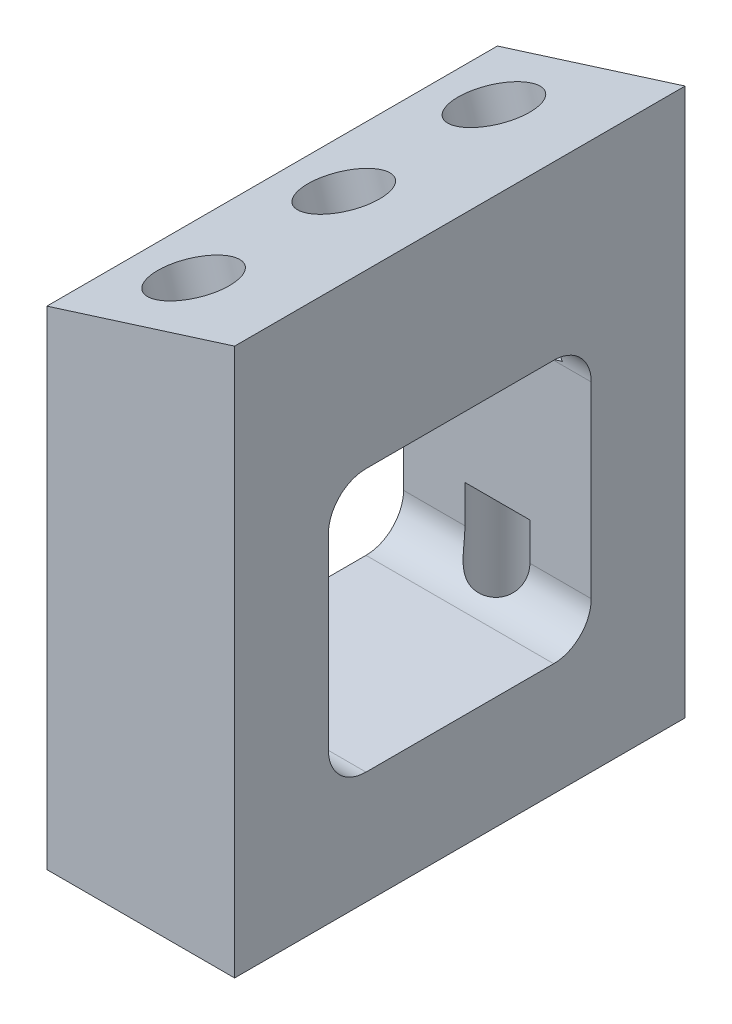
ISO-10303-21;
HEADER;
FILE_DESCRIPTION(('STEP AP214'),'2;1');
FILE_NAME('part.step','',(''),(''),'','','');
FILE_SCHEMA(('AUTOMOTIVE_DESIGN { 1 0 10303 214 1 1 1 1 }'));
ENDSEC;
DATA;
#1=APPLICATION_CONTEXT('core data for automotive mechanical design processes');
#2=APPLICATION_PROTOCOL_DEFINITION('international standard','automotive_design',2000,#1);
#3=PRODUCT_CONTEXT('',#1,'mechanical');
#4=PRODUCT('Part','Part','',(#3));
#5=PRODUCT_RELATED_PRODUCT_CATEGORY('part','',(#4));
#6=PRODUCT_DEFINITION_FORMATION('','',#4);
#7=PRODUCT_DEFINITION_CONTEXT('part definition',#1,'design');
#8=PRODUCT_DEFINITION('design','',#6,#7);
#9=PRODUCT_DEFINITION_SHAPE('','',#8);
#10=(LENGTH_UNIT() NAMED_UNIT(*) SI_UNIT(.MILLI.,.METRE.));
#11=(NAMED_UNIT(*) PLANE_ANGLE_UNIT() SI_UNIT($,.RADIAN.));
#12=(NAMED_UNIT(*) SI_UNIT($,.STERADIAN.) SOLID_ANGLE_UNIT());
#13=UNCERTAINTY_MEASURE_WITH_UNIT(LENGTH_MEASURE(1.E-05),#10,'distance_accuracy_value','');
#14=(GEOMETRIC_REPRESENTATION_CONTEXT(3) GLOBAL_UNCERTAINTY_ASSIGNED_CONTEXT((#13)) GLOBAL_UNIT_ASSIGNED_CONTEXT((#10,
#11,#12)) REPRESENTATION_CONTEXT('',''));
#15=CARTESIAN_POINT('',(0.,0.,0.));
#16=DIRECTION('',(0.,0.,1.));
#17=DIRECTION('',(1.,0.,0.));
#18=AXIS2_PLACEMENT_3D('',#15,#16,#17);
#19=CARTESIAN_POINT('',(0.,0.,19.05));
#20=DIRECTION('',(0.,1.,0.));
#21=DIRECTION('',(0.,0.,1.));
#22=AXIS2_PLACEMENT_3D('',#19,#20,#21);
#23=PLANE('',#22);
#24=CARTESIAN_POINT('',(0.,0.,-12.7));
#25=DIRECTION('',(0.,-1.,0.));
#26=DIRECTION('',(0.,0.,-1.));
#27=AXIS2_PLACEMENT_3D('',#24,#25,#26);
#28=CIRCLE('',#27,3.175);
#29=CARTESIAN_POINT('',(0.,0.,-15.875));
#30=VERTEX_POINT('',#29);
#31=EDGE_CURVE('E183',#30,#30,#28,.T.);
#32=ORIENTED_EDGE('',*,*,#31,.F.);
#33=EDGE_LOOP('',(#32));
#34=FACE_BOUND('',#33,.T.);
#35=CARTESIAN_POINT('',(0.,0.,12.7));
#36=DIRECTION('',(0.,-1.,0.));
#37=DIRECTION('',(0.,0.,-1.));
#38=AXIS2_PLACEMENT_3D('',#35,#36,#37);
#39=CIRCLE('',#38,3.175);
#40=CARTESIAN_POINT('',(0.,0.,9.525));
#41=VERTEX_POINT('',#40);
#42=EDGE_CURVE('E179',#41,#41,#39,.T.);
#43=ORIENTED_EDGE('',*,*,#42,.F.);
#44=EDGE_LOOP('',(#43));
#45=FACE_BOUND('',#44,.T.);
#46=DIRECTION('',(1.,0.,0.));
#47=VECTOR('',#46,1.);
#48=CARTESIAN_POINT('',(0.,0.,-19.05));
#49=LINE('',#48,#47);
#50=CARTESIAN_POINT('',(-7.9375,0.,-19.05));
#51=VERTEX_POINT('',#50);
#52=CARTESIAN_POINT('',(7.9375,0.,-19.05));
#53=VERTEX_POINT('',#52);
#54=EDGE_CURVE('E239',#51,#53,#49,.T.);
#55=ORIENTED_EDGE('',*,*,#54,.T.);
#56=DIRECTION('',(0.,0.,-1.));
#57=VECTOR('',#56,1.);
#58=CARTESIAN_POINT('',(7.9375,0.,19.05));
#59=LINE('',#58,#57);
#60=CARTESIAN_POINT('',(7.9375,0.,19.05));
#61=VERTEX_POINT('',#60);
#62=EDGE_CURVE('E265',#61,#53,#59,.T.);
#63=ORIENTED_EDGE('',*,*,#62,.F.);
#64=DIRECTION('',(1.,0.,0.));
#65=VECTOR('',#64,1.);
#66=CARTESIAN_POINT('',(-7.9375,0.,19.05));
#67=LINE('',#66,#65);
#68=CARTESIAN_POINT('',(-7.9375,0.,19.05));
#69=VERTEX_POINT('',#68);
#70=EDGE_CURVE('E240',#69,#61,#67,.T.);
#71=ORIENTED_EDGE('',*,*,#70,.F.);
#72=DIRECTION('',(0.,0.,-1.));
#73=VECTOR('',#72,1.);
#74=CARTESIAN_POINT('',(-7.9375,0.,19.05));
#75=LINE('',#74,#73);
#76=EDGE_CURVE('E249',#69,#51,#75,.T.);
#77=ORIENTED_EDGE('',*,*,#76,.T.);
#78=EDGE_LOOP('',(#55,#63,#71,#77));
#79=FACE_BOUND('',#78,.T.);
#80=ADVANCED_FACE('F35',(#34,#45,#79),#23,.F.);
#81=CARTESIAN_POINT('',(7.9375,0.,19.05));
#82=DIRECTION('',(-1.,0.,0.));
#83=DIRECTION('',(0.,0.,1.));
#84=AXIS2_PLACEMENT_3D('',#81,#82,#83);
#85=PLANE('',#84);
#86=DIRECTION('',(0.,-1.,0.));
#87=VECTOR('',#86,1.);
#88=CARTESIAN_POINT('',(7.9375,0.,-11.1125));
#89=LINE('',#88,#87);
#90=CARTESIAN_POINT('',(7.9375,28.575,-11.1125));
#91=VERTEX_POINT('',#90);
#92=CARTESIAN_POINT('',(7.9375,12.7,-11.1125));
#93=VERTEX_POINT('',#92);
#94=EDGE_CURVE('E230',#91,#93,#89,.T.);
#95=ORIENTED_EDGE('',*,*,#94,.T.);
#96=CARTESIAN_POINT('',(7.9375,12.7,-7.9375));
#97=DIRECTION('',(-1.,0.,0.));
#98=DIRECTION('',(0.,0.,1.));
#99=AXIS2_PLACEMENT_3D('',#96,#97,#98);
#100=CIRCLE('',#99,3.175);
#101=CARTESIAN_POINT('',(7.9375,9.525,-7.9375));
#102=VERTEX_POINT('',#101);
#103=EDGE_CURVE('E304',#93,#102,#100,.T.);
#104=ORIENTED_EDGE('',*,*,#103,.T.);
#105=DIRECTION('',(0.,0.,1.));
#106=VECTOR('',#105,1.);
#107=CARTESIAN_POINT('',(7.9375,9.525,19.05));
#108=LINE('',#107,#106);
#109=CARTESIAN_POINT('',(7.9375,9.525,7.9375));
#110=VERTEX_POINT('',#109);
#111=EDGE_CURVE('E227',#102,#110,#108,.T.);
#112=ORIENTED_EDGE('',*,*,#111,.T.);
#113=CARTESIAN_POINT('',(7.9375,12.7,7.9375));
#114=DIRECTION('',(-1.,0.,0.));
#115=DIRECTION('',(0.,0.,1.));
#116=AXIS2_PLACEMENT_3D('',#113,#114,#115);
#117=CIRCLE('',#116,3.175);
#118=CARTESIAN_POINT('',(7.9375,12.7,11.1125));
#119=VERTEX_POINT('',#118);
#120=EDGE_CURVE('E316',#110,#119,#117,.T.);
#121=ORIENTED_EDGE('',*,*,#120,.T.);
#122=DIRECTION('',(0.,1.,0.));
#123=VECTOR('',#122,1.);
#124=CARTESIAN_POINT('',(7.9375,0.,11.1125));
#125=LINE('',#124,#123);
#126=CARTESIAN_POINT('',(7.9375,28.575,11.1125));
#127=VERTEX_POINT('',#126);
#128=EDGE_CURVE('E236',#119,#127,#125,.T.);
#129=ORIENTED_EDGE('',*,*,#128,.T.);
#130=CARTESIAN_POINT('',(7.9375,28.575,7.9375));
#131=DIRECTION('',(-1.,0.,0.));
#132=DIRECTION('',(0.,0.,1.));
#133=AXIS2_PLACEMENT_3D('',#130,#131,#132);
#134=CIRCLE('',#133,3.175);
#135=CARTESIAN_POINT('',(7.9375,31.75,7.9375));
#136=VERTEX_POINT('',#135);
#137=EDGE_CURVE('E312',#127,#136,#134,.T.);
#138=ORIENTED_EDGE('',*,*,#137,.T.);
#139=DIRECTION('',(0.,0.,-1.));
#140=VECTOR('',#139,1.);
#141=CARTESIAN_POINT('',(7.9375,31.75,19.05));
#142=LINE('',#141,#140);
#143=CARTESIAN_POINT('',(7.9375,31.75,-7.9375));
#144=VERTEX_POINT('',#143);
#145=EDGE_CURVE('E233',#136,#144,#142,.T.);
#146=ORIENTED_EDGE('',*,*,#145,.T.);
#147=CARTESIAN_POINT('',(7.9375,28.575,-7.9375));
#148=DIRECTION('',(-1.,0.,0.));
#149=DIRECTION('',(0.,0.,1.));
#150=AXIS2_PLACEMENT_3D('',#147,#148,#149);
#151=CIRCLE('',#150,3.175);
#152=EDGE_CURVE('E308',#144,#91,#151,.T.);
#153=ORIENTED_EDGE('',*,*,#152,.T.);
#154=EDGE_LOOP('',(#95,#104,#112,#121,#129,#138,#146,#153));
#155=FACE_BOUND('',#154,.T.);
#156=DIRECTION('',(0.,1.,0.));
#157=VECTOR('',#156,1.);
#158=CARTESIAN_POINT('',(7.9375,0.,-19.05));
#159=LINE('',#158,#157);
#160=CARTESIAN_POINT('',(7.9375,46.2803682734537,-19.05));
#161=VERTEX_POINT('',#160);
#162=EDGE_CURVE('E251',#53,#161,#159,.T.);
#163=ORIENTED_EDGE('',*,*,#162,.T.);
#164=DIRECTION('',(0.,0.,-1.));
#165=VECTOR('',#164,1.);
#166=CARTESIAN_POINT('',(7.9375,46.2803682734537,19.05));
#167=LINE('',#166,#165);
#168=CARTESIAN_POINT('',(7.9375,46.2803682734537,19.05));
#169=VERTEX_POINT('',#168);
#170=EDGE_CURVE('E262',#169,#161,#167,.T.);
#171=ORIENTED_EDGE('',*,*,#170,.F.);
#172=DIRECTION('',(0.,1.,0.));
#173=VECTOR('',#172,1.);
#174=CARTESIAN_POINT('',(7.9375,0.,19.05));
#175=LINE('',#174,#173);
#176=EDGE_CURVE('E242',#61,#169,#175,.T.);
#177=ORIENTED_EDGE('',*,*,#176,.F.);
#178=ORIENTED_EDGE('',*,*,#62,.T.);
#179=EDGE_LOOP('',(#163,#171,#177,#178));
#180=FACE_BOUND('',#179,.T.);
#181=ADVANCED_FACE('F378',(#155,#180),#85,.F.);
#182=CARTESIAN_POINT('',(7.9375,46.2803682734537,19.05));
#183=DIRECTION('',(0.300705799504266,-0.953716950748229,0.));
#184=DIRECTION('',(0.953716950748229,0.300705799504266,0.));
#185=AXIS2_PLACEMENT_3D('',#182,#183,#184);
#186=PLANE('',#185);
#187=CARTESIAN_POINT('',(-1.88139736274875,43.1844818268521,-12.7));
#188=DIRECTION('',(-0.300705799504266,0.953716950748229,0.));
#189=DIRECTION('',(-0.953716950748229,-0.300705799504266,0.));
#190=AXIS2_PLACEMENT_3D('',#187,#188,#189);
#191=CIRCLE('',#190,3.175);
#192=CARTESIAN_POINT('',(-4.90944868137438,42.229740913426,-12.7));
#193=VERTEX_POINT('',#192);
#194=EDGE_CURVE('E202',#193,#193,#191,.T.);
#195=ORIENTED_EDGE('',*,*,#194,.F.);
#196=EDGE_LOOP('',(#195));
#197=FACE_BOUND('',#196,.T.);
#198=CARTESIAN_POINT('',(-1.88139736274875,43.1844818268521,12.7));
#199=DIRECTION('',(-0.300705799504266,0.953716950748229,0.));
#200=DIRECTION('',(-0.953716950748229,-0.300705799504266,0.));
#201=AXIS2_PLACEMENT_3D('',#198,#199,#200);
#202=CIRCLE('',#201,3.175);
#203=CARTESIAN_POINT('',(-4.90944868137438,42.229740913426,12.7));
#204=VERTEX_POINT('',#203);
#205=EDGE_CURVE('E213',#204,#204,#202,.T.);
#206=ORIENTED_EDGE('',*,*,#205,.F.);
#207=EDGE_LOOP('',(#206));
#208=FACE_BOUND('',#207,.T.);
#209=CARTESIAN_POINT('',(-1.88139736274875,43.1844818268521,0.));
#210=DIRECTION('',(-0.300705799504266,0.953716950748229,0.));
#211=DIRECTION('',(-0.953716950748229,-0.300705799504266,0.));
#212=AXIS2_PLACEMENT_3D('',#209,#210,#211);
#213=CIRCLE('',#212,3.175);
#214=CARTESIAN_POINT('',(-4.90944868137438,42.229740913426,0.));
#215=VERTEX_POINT('',#214);
#216=EDGE_CURVE('E223',#215,#215,#213,.T.);
#217=ORIENTED_EDGE('',*,*,#216,.F.);
#218=EDGE_LOOP('',(#217));
#219=FACE_BOUND('',#218,.T.);
#220=DIRECTION('',(-0.953716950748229,-0.300705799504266,0.));
#221=VECTOR('',#220,1.);
#222=CARTESIAN_POINT('',(7.9375,46.2803682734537,-19.05));
#223=LINE('',#222,#221);
#224=CARTESIAN_POINT('',(-7.93750000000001,41.275,-19.05));
#225=VERTEX_POINT('',#224);
#226=EDGE_CURVE('E253',#161,#225,#223,.T.);
#227=ORIENTED_EDGE('',*,*,#226,.T.);
#228=DIRECTION('',(0.,0.,-1.));
#229=VECTOR('',#228,1.);
#230=CARTESIAN_POINT('',(-7.93750000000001,41.275,19.05));
#231=LINE('',#230,#229);
#232=CARTESIAN_POINT('',(-7.93750000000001,41.275,19.05));
#233=VERTEX_POINT('',#232);
#234=EDGE_CURVE('E259',#233,#225,#231,.T.);
#235=ORIENTED_EDGE('',*,*,#234,.F.);
#236=DIRECTION('',(-0.953716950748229,-0.300705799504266,0.));
#237=VECTOR('',#236,1.);
#238=CARTESIAN_POINT('',(7.9375,46.2803682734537,19.05));
#239=LINE('',#238,#237);
#240=EDGE_CURVE('E245',#169,#233,#239,.T.);
#241=ORIENTED_EDGE('',*,*,#240,.F.);
#242=ORIENTED_EDGE('',*,*,#170,.T.);
#243=EDGE_LOOP('',(#227,#235,#241,#242));
#244=FACE_BOUND('',#243,.T.);
#245=ADVANCED_FACE('F374',(#197,#208,#219,#244),#186,.F.);
#246=CARTESIAN_POINT('',(-7.93750000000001,41.275,19.05));
#247=DIRECTION('',(1.,0.,0.));
#248=DIRECTION('',(0.,1.,0.));
#249=AXIS2_PLACEMENT_3D('',#246,#247,#248);
#250=PLANE('',#249);
#251=DIRECTION('',(0.,1.,0.));
#252=VECTOR('',#251,1.);
#253=CARTESIAN_POINT('',(-7.93750000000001,41.275,-11.1125));
#254=LINE('',#253,#252);
#255=CARTESIAN_POINT('',(-7.9375,12.7,-11.1125));
#256=VERTEX_POINT('',#255);
#257=CARTESIAN_POINT('',(-7.9375,28.575,-11.1125));
#258=VERTEX_POINT('',#257);
#259=EDGE_CURVE('E271',#256,#258,#254,.T.);
#260=ORIENTED_EDGE('',*,*,#259,.T.);
#261=CARTESIAN_POINT('',(-7.9375,28.575,-7.9375));
#262=DIRECTION('',(1.,0.,0.));
#263=DIRECTION('',(0.,1.,0.));
#264=AXIS2_PLACEMENT_3D('',#261,#262,#263);
#265=CIRCLE('',#264,3.175);
#266=CARTESIAN_POINT('',(-7.9375,31.75,-7.9375));
#267=VERTEX_POINT('',#266);
#268=EDGE_CURVE('E310',#258,#267,#265,.T.);
#269=ORIENTED_EDGE('',*,*,#268,.T.);
#270=DIRECTION('',(0.,0.,1.));
#271=VECTOR('',#270,1.);
#272=CARTESIAN_POINT('',(-7.9375,31.75,19.05));
#273=LINE('',#272,#271);
#274=CARTESIAN_POINT('',(-7.9375,31.75,7.9375));
#275=VERTEX_POINT('',#274);
#276=EDGE_CURVE('E274',#267,#275,#273,.T.);
#277=ORIENTED_EDGE('',*,*,#276,.T.);
#278=CARTESIAN_POINT('',(-7.9375,28.575,7.9375));
#279=DIRECTION('',(1.,0.,0.));
#280=DIRECTION('',(0.,1.,0.));
#281=AXIS2_PLACEMENT_3D('',#278,#279,#280);
#282=CIRCLE('',#281,3.175);
#283=CARTESIAN_POINT('',(-7.9375,28.575,11.1125));
#284=VERTEX_POINT('',#283);
#285=EDGE_CURVE('E314',#275,#284,#282,.T.);
#286=ORIENTED_EDGE('',*,*,#285,.T.);
#287=DIRECTION('',(0.,-1.,0.));
#288=VECTOR('',#287,1.);
#289=CARTESIAN_POINT('',(-7.93750000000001,41.275,11.1125));
#290=LINE('',#289,#288);
#291=CARTESIAN_POINT('',(-7.9375,12.7,11.1125));
#292=VERTEX_POINT('',#291);
#293=EDGE_CURVE('E277',#284,#292,#290,.T.);
#294=ORIENTED_EDGE('',*,*,#293,.T.);
#295=CARTESIAN_POINT('',(-7.9375,12.7,7.9375));
#296=DIRECTION('',(1.,0.,0.));
#297=DIRECTION('',(0.,1.,0.));
#298=AXIS2_PLACEMENT_3D('',#295,#296,#297);
#299=CIRCLE('',#298,3.175);
#300=CARTESIAN_POINT('',(-7.9375,9.52500000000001,7.9375));
#301=VERTEX_POINT('',#300);
#302=EDGE_CURVE('E318',#292,#301,#299,.T.);
#303=ORIENTED_EDGE('',*,*,#302,.T.);
#304=DIRECTION('',(0.,0.,-1.));
#305=VECTOR('',#304,1.);
#306=CARTESIAN_POINT('',(-7.9375,9.52500000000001,19.05));
#307=LINE('',#306,#305);
#308=CARTESIAN_POINT('',(-7.9375,9.52500000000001,-7.9375));
#309=VERTEX_POINT('',#308);
#310=EDGE_CURVE('E268',#301,#309,#307,.T.);
#311=ORIENTED_EDGE('',*,*,#310,.T.);
#312=CARTESIAN_POINT('',(-7.9375,12.7,-7.9375));
#313=DIRECTION('',(1.,0.,0.));
#314=DIRECTION('',(0.,1.,0.));
#315=AXIS2_PLACEMENT_3D('',#312,#313,#314);
#316=CIRCLE('',#315,3.175);
#317=EDGE_CURVE('E306',#309,#256,#316,.T.);
#318=ORIENTED_EDGE('',*,*,#317,.T.);
#319=EDGE_LOOP('',(#260,#269,#277,#286,#294,#303,#311,#318));
#320=FACE_BOUND('',#319,.T.);
#321=DIRECTION('',(0.,-1.,0.));
#322=VECTOR('',#321,1.);
#323=CARTESIAN_POINT('',(-7.93750000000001,41.275,-19.05));
#324=LINE('',#323,#322);
#325=EDGE_CURVE('E243',#225,#51,#324,.T.);
#326=ORIENTED_EDGE('',*,*,#325,.T.);
#327=ORIENTED_EDGE('',*,*,#76,.F.);
#328=DIRECTION('',(0.,-1.,0.));
#329=VECTOR('',#328,1.);
#330=CARTESIAN_POINT('',(-7.93750000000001,41.275,19.05));
#331=LINE('',#330,#329);
#332=EDGE_CURVE('E247',#233,#69,#331,.T.);
#333=ORIENTED_EDGE('',*,*,#332,.F.);
#334=ORIENTED_EDGE('',*,*,#234,.T.);
#335=EDGE_LOOP('',(#326,#327,#333,#334));
#336=FACE_BOUND('',#335,.T.);
#337=ADVANCED_FACE('F367',(#320,#336),#250,.F.);
#338=CARTESIAN_POINT('',(0.,0.,19.05));
#339=DIRECTION('',(0.,0.,1.));
#340=DIRECTION('',(1.,0.,0.));
#341=AXIS2_PLACEMENT_3D('',#338,#339,#340);
#342=PLANE('',#341);
#343=ORIENTED_EDGE('',*,*,#70,.T.);
#344=ORIENTED_EDGE('',*,*,#176,.T.);
#345=ORIENTED_EDGE('',*,*,#240,.T.);
#346=ORIENTED_EDGE('',*,*,#332,.T.);
#347=EDGE_LOOP('',(#343,#344,#345,#346));
#348=FACE_BOUND('',#347,.T.);
#349=ADVANCED_FACE('F364',(#348),#342,.T.);
#350=CARTESIAN_POINT('',(0.,0.,-19.05));
#351=DIRECTION('',(0.,0.,1.));
#352=DIRECTION('',(1.,0.,0.));
#353=AXIS2_PLACEMENT_3D('',#350,#351,#352);
#354=PLANE('',#353);
#355=ORIENTED_EDGE('',*,*,#54,.F.);
#356=ORIENTED_EDGE('',*,*,#325,.F.);
#357=ORIENTED_EDGE('',*,*,#226,.F.);
#358=ORIENTED_EDGE('',*,*,#162,.F.);
#359=EDGE_LOOP('',(#355,#356,#357,#358));
#360=FACE_BOUND('',#359,.T.);
#361=ADVANCED_FACE('F362',(#360),#354,.F.);
#362=CARTESIAN_POINT('',(-19.05,31.75,11.1125));
#363=DIRECTION('',(0.,0.,1.));
#364=DIRECTION('',(0.,-1.,0.));
#365=AXIS2_PLACEMENT_3D('',#362,#363,#364);
#366=PLANE('',#365);
#367=DIRECTION('',(1.,0.,0.));
#368=VECTOR('',#367,1.);
#369=CARTESIAN_POINT('',(-19.05,15.875,11.1125));
#370=LINE('',#369,#368);
#371=CARTESIAN_POINT('',(-2.74963065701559,15.875,11.1125));
#372=VERTEX_POINT('',#371);
#373=CARTESIAN_POINT('',(2.74963065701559,15.875,11.1125));
#374=VERTEX_POINT('',#373);
#375=EDGE_CURVE('E395',#372,#374,#370,.T.);
#376=ORIENTED_EDGE('',*,*,#375,.F.);
#377=DIRECTION('',(0.,-1.,0.));
#378=VECTOR('',#377,1.);
#379=CARTESIAN_POINT('',(-2.74963065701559,15.875,11.1125));
#380=LINE('',#379,#378);
#381=CARTESIAN_POINT('',(-2.74963065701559,12.7,11.1125));
#382=VERTEX_POINT('',#381);
#383=EDGE_CURVE('E199',#372,#382,#380,.T.);
#384=ORIENTED_EDGE('',*,*,#383,.T.);
#385=DIRECTION('',(1.,0.,0.));
#386=VECTOR('',#385,1.);
#387=CARTESIAN_POINT('',(-7.93750000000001,12.7,11.1125));
#388=LINE('',#387,#386);
#389=EDGE_CURVE('E296',#382,#292,#388,.F.);
#390=ORIENTED_EDGE('',*,*,#389,.T.);
#391=ORIENTED_EDGE('',*,*,#293,.F.);
#392=DIRECTION('',(1.,0.,0.));
#393=VECTOR('',#392,1.);
#394=CARTESIAN_POINT('',(7.93749999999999,28.575,11.1125));
#395=LINE('',#394,#393);
#396=CARTESIAN_POINT('',(-0.158113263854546,28.5750000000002,11.1125));
#397=VERTEX_POINT('',#396);
#398=EDGE_CURVE('E301',#284,#397,#395,.T.);
#399=ORIENTED_EDGE('',*,*,#398,.T.);
#400=DIRECTION('',(-0.300705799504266,0.953716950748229,0.));
#401=VECTOR('',#400,1.);
#402=CARTESIAN_POINT('',(0.269937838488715,27.2173953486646,11.1125));
#403=LINE('',#402,#401);
#404=CARTESIAN_POINT('',(0.269937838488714,27.2173953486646,11.1125));
#405=VERTEX_POINT('',#404);
#406=EDGE_CURVE('E220',#397,#405,#403,.F.);
#407=ORIENTED_EDGE('',*,*,#406,.T.);
#408=DIRECTION('',(-0.953716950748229,-0.300705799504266,0.));
#409=VECTOR('',#408,1.);
#410=CARTESIAN_POINT('',(-16.0031167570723,22.0865209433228,11.1125));
#411=LINE('',#410,#409);
#412=CARTESIAN_POINT('',(4.57570969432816,28.575,11.1125));
#413=VERTEX_POINT('',#412);
#414=EDGE_CURVE('E216',#413,#405,#411,.T.);
#415=ORIENTED_EDGE('',*,*,#414,.F.);
#416=EDGE_CURVE('E300',#413,#127,#395,.T.);
#417=ORIENTED_EDGE('',*,*,#416,.T.);
#418=ORIENTED_EDGE('',*,*,#128,.F.);
#419=CARTESIAN_POINT('',(2.74963065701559,12.7,11.1125));
#420=VERTEX_POINT('',#419);
#421=EDGE_CURVE('E297',#119,#420,#388,.F.);
#422=ORIENTED_EDGE('',*,*,#421,.T.);
#423=DIRECTION('',(0.,-1.,0.));
#424=VECTOR('',#423,1.);
#425=CARTESIAN_POINT('',(2.74963065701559,15.875,11.1125));
#426=LINE('',#425,#424);
#427=EDGE_CURVE('E59',#420,#374,#426,.F.);
#428=ORIENTED_EDGE('',*,*,#427,.T.);
#429=EDGE_LOOP('',(#376,#384,#390,#391,#399,#407,#415,#417,#418,#422,#428));
#430=FACE_BOUND('',#429,.T.);
#431=ADVANCED_FACE('F351',(#430),#366,.F.);
#432=CARTESIAN_POINT('',(-19.05,31.75,-11.1125));
#433=DIRECTION('',(0.,1.,0.));
#434=DIRECTION('',(0.,0.,1.));
#435=AXIS2_PLACEMENT_3D('',#432,#433,#434);
#436=PLANE('',#435);
#437=CARTESIAN_POINT('',(1.72388090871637,31.75,0.));
#438=DIRECTION('',(0.,1.,0.));
#439=DIRECTION('',(-1.,0.,0.));
#440=AXIS2_PLACEMENT_3D('',#437,#438,#439);
#441=ELLIPSE('',#440,3.32907997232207,3.175);
#442=CARTESIAN_POINT('',(-1.6051990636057,31.75,0.));
#443=VERTEX_POINT('',#442);
#444=EDGE_CURVE('E226',#443,#443,#441,.T.);
#445=ORIENTED_EDGE('',*,*,#444,.T.);
#446=EDGE_LOOP('',(#445));
#447=FACE_BOUND('',#446,.T.);
#448=ORIENTED_EDGE('',*,*,#276,.F.);
#449=DIRECTION('',(1.,0.,0.));
#450=VECTOR('',#449,1.);
#451=CARTESIAN_POINT('',(7.93749999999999,31.75,-7.9375));
#452=LINE('',#451,#450);
#453=EDGE_CURVE('E293',#267,#144,#452,.T.);
#454=ORIENTED_EDGE('',*,*,#453,.T.);
#455=ORIENTED_EDGE('',*,*,#145,.F.);
#456=DIRECTION('',(1.,0.,0.));
#457=VECTOR('',#456,1.);
#458=CARTESIAN_POINT('',(-7.93750000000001,31.75,7.9375));
#459=LINE('',#458,#457);
#460=EDGE_CURVE('E291',#136,#275,#459,.F.);
#461=ORIENTED_EDGE('',*,*,#460,.T.);
#462=EDGE_LOOP('',(#448,#454,#455,#461));
#463=FACE_BOUND('',#462,.T.);
#464=ADVANCED_FACE('F348',(#447,#463),#436,.F.);
#465=CARTESIAN_POINT('',(-19.05,9.525,-11.1125));
#466=DIRECTION('',(0.,0.,-1.));
#467=DIRECTION('',(0.,1.,0.));
#468=AXIS2_PLACEMENT_3D('',#465,#466,#467);
#469=PLANE('',#468);
#470=DIRECTION('',(-1.,0.,0.));
#471=VECTOR('',#470,1.);
#472=CARTESIAN_POINT('',(-19.05,15.875,-11.1125));
#473=LINE('',#472,#471);
#474=CARTESIAN_POINT('',(2.74963065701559,15.875,-11.1125));
#475=VERTEX_POINT('',#474);
#476=CARTESIAN_POINT('',(-2.74963065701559,15.875,-11.1125));
#477=VERTEX_POINT('',#476);
#478=EDGE_CURVE('E11',#475,#477,#473,.T.);
#479=ORIENTED_EDGE('',*,*,#478,.F.);
#480=DIRECTION('',(0.,-1.,0.));
#481=VECTOR('',#480,1.);
#482=CARTESIAN_POINT('',(2.74963065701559,15.875,-11.1125));
#483=LINE('',#482,#481);
#484=CARTESIAN_POINT('',(2.74963065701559,12.7,-11.1125));
#485=VERTEX_POINT('',#484);
#486=EDGE_CURVE('E172',#475,#485,#483,.T.);
#487=ORIENTED_EDGE('',*,*,#486,.T.);
#488=DIRECTION('',(1.,0.,0.));
#489=VECTOR('',#488,1.);
#490=CARTESIAN_POINT('',(7.93749999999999,12.7,-11.1125));
#491=LINE('',#490,#489);
#492=EDGE_CURVE('E284',#485,#93,#491,.T.);
#493=ORIENTED_EDGE('',*,*,#492,.T.);
#494=ORIENTED_EDGE('',*,*,#94,.F.);
#495=DIRECTION('',(1.,0.,0.));
#496=VECTOR('',#495,1.);
#497=CARTESIAN_POINT('',(-7.93750000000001,28.575,-11.1125));
#498=LINE('',#497,#496);
#499=CARTESIAN_POINT('',(4.57570969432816,28.575,-11.1125));
#500=VERTEX_POINT('',#499);
#501=EDGE_CURVE('E281',#91,#500,#498,.F.);
#502=ORIENTED_EDGE('',*,*,#501,.T.);
#503=DIRECTION('',(0.953716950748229,0.300705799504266,0.));
#504=VECTOR('',#503,1.);
#505=CARTESIAN_POINT('',(-22.3769849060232,20.0768480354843,-11.1125));
#506=LINE('',#505,#504);
#507=CARTESIAN_POINT('',(0.269937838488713,27.2173953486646,-11.1125));
#508=VERTEX_POINT('',#507);
#509=EDGE_CURVE('E206',#508,#500,#506,.T.);
#510=ORIENTED_EDGE('',*,*,#509,.F.);
#511=DIRECTION('',(-0.300705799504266,0.953716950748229,0.));
#512=VECTOR('',#511,1.);
#513=CARTESIAN_POINT('',(0.269937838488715,27.2173953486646,-11.1125));
#514=LINE('',#513,#512);
#515=CARTESIAN_POINT('',(-0.158113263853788,28.575,-11.1125));
#516=VERTEX_POINT('',#515);
#517=EDGE_CURVE('E210',#508,#516,#514,.T.);
#518=ORIENTED_EDGE('',*,*,#517,.T.);
#519=EDGE_CURVE('E280',#516,#258,#498,.F.);
#520=ORIENTED_EDGE('',*,*,#519,.T.);
#521=ORIENTED_EDGE('',*,*,#259,.F.);
#522=CARTESIAN_POINT('',(-2.74963065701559,12.7,-11.1125));
#523=VERTEX_POINT('',#522);
#524=EDGE_CURVE('E189',#256,#523,#491,.T.);
#525=ORIENTED_EDGE('',*,*,#524,.T.);
#526=DIRECTION('',(0.,-1.,0.));
#527=VECTOR('',#526,1.);
#528=CARTESIAN_POINT('',(-2.74963065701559,15.875,-11.1125));
#529=LINE('',#528,#527);
#530=EDGE_CURVE('E51',#523,#477,#529,.F.);
#531=ORIENTED_EDGE('',*,*,#530,.T.);
#532=EDGE_LOOP('',(#479,#487,#493,#494,#502,#510,#518,#520,#521,#525,#531));
#533=FACE_BOUND('',#532,.T.);
#534=ADVANCED_FACE('F185',(#533),#469,.F.);
#535=CARTESIAN_POINT('',(-19.05,9.525,11.1125));
#536=DIRECTION('',(0.,-1.,0.));
#537=DIRECTION('',(0.,0.,-1.));
#538=AXIS2_PLACEMENT_3D('',#535,#536,#537);
#539=PLANE('',#538);
#540=ORIENTED_EDGE('',*,*,#111,.F.);
#541=DIRECTION('',(1.,0.,0.));
#542=VECTOR('',#541,1.);
#543=CARTESIAN_POINT('',(-7.9375,9.525,-7.9375));
#544=LINE('',#543,#542);
#545=EDGE_CURVE('E289',#102,#309,#544,.F.);
#546=ORIENTED_EDGE('',*,*,#545,.T.);
#547=ORIENTED_EDGE('',*,*,#310,.F.);
#548=DIRECTION('',(1.,0.,0.));
#549=VECTOR('',#548,1.);
#550=CARTESIAN_POINT('',(7.9375,9.525,7.9375));
#551=LINE('',#550,#549);
#552=EDGE_CURVE('E286',#301,#110,#551,.T.);
#553=ORIENTED_EDGE('',*,*,#552,.T.);
#554=EDGE_LOOP('',(#540,#546,#547,#553));
#555=FACE_BOUND('',#554,.T.);
#556=ADVANCED_FACE('F355',(#555),#539,.F.);
#557=CARTESIAN_POINT('',(-19.05,12.7,-7.9375));
#558=DIRECTION('',(-1.,0.,0.));
#559=DIRECTION('',(0.,0.,1.));
#560=AXIS2_PLACEMENT_3D('',#557,#558,#559);
#561=CYLINDRICAL_SURFACE('',#560,3.175);
#562=ORIENTED_EDGE('',*,*,#492,.F.);
#563=CARTESIAN_POINT('',(2.74963065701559,12.7,-11.1125));
#564=CARTESIAN_POINT('',(2.74963671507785,12.5515086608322,-11.1124925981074));
#565=CARTESIAN_POINT('',(2.74366954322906,12.4029099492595,-11.1020330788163));
#566=CARTESIAN_POINT('',(2.71912544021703,12.1094904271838,-11.0606268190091));
#567=CARTESIAN_POINT('',(2.70053197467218,11.9646748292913,-11.029653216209));
#568=CARTESIAN_POINT('',(2.64875687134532,11.6827624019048,-10.9487084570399));
#569=CARTESIAN_POINT('',(2.61554372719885,11.5456829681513,-10.8986963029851));
#570=CARTESIAN_POINT('',(2.53187079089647,11.2840851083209,-10.7828868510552));
#571=CARTESIAN_POINT('',(2.48142688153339,11.1595552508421,-10.7171041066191));
#572=CARTESIAN_POINT('',(2.3633209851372,10.9319686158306,-10.5779066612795));
#573=CARTESIAN_POINT('',(2.29646073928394,10.8282350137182,-10.5049221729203));
#574=CARTESIAN_POINT('',(2.14369729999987,10.6388565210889,-10.3555297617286));
#575=CARTESIAN_POINT('',(2.05780266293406,10.5532035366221,-10.2791233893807));
#576=CARTESIAN_POINT('',(1.87503915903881,10.4065705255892,-10.1353641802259));
#577=CARTESIAN_POINT('',(1.77944624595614,10.3442370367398,-10.0677591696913));
#578=CARTESIAN_POINT('',(1.57497486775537,10.2351532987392,-9.94054731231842));
#579=CARTESIAN_POINT('',(1.46609269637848,10.1884074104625,-9.88094270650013));
#580=CARTESIAN_POINT('',(1.23543338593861,10.1079901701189,-9.77238304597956));
#581=CARTESIAN_POINT('',(1.11342498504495,10.0746295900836,-9.72369157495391));
#582=CARTESIAN_POINT('',(0.861796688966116,10.0204416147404,-9.64132711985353));
#583=CARTESIAN_POINT('',(0.73217409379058,9.99961869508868,-9.60765950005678));
#584=CARTESIAN_POINT('',(0.457303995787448,9.96755769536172,-9.5547310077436));
#585=CARTESIAN_POINT('',(0.311663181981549,9.95728123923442,-9.53693253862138));
#586=CARTESIAN_POINT('',(0.0188586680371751,9.94843614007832,-9.52167524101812));
#587=CARTESIAN_POINT('',(-0.128305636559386,9.94987233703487,-9.5242248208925));
#588=CARTESIAN_POINT('',(-0.350826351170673,9.96112841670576,-9.54349990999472));
#589=CARTESIAN_POINT('',(-0.427122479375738,9.96664701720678,-9.55292513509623));
#590=CARTESIAN_POINT('',(-0.578503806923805,9.9811423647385,-9.57720917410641));
#591=CARTESIAN_POINT('',(-0.653589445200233,9.99011782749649,-9.59206597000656));
#592=CARTESIAN_POINT('',(-0.802016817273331,10.0117717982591,-9.62701901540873));
#593=CARTESIAN_POINT('',(-0.875357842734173,10.0244517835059,-9.64711735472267));
#594=CARTESIAN_POINT('',(-1.01965216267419,10.0538233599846,-9.69223605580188));
#595=CARTESIAN_POINT('',(-1.09060656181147,10.0705130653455,-9.71725410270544));
#596=CARTESIAN_POINT('',(-1.22813137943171,10.107878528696,-9.77123536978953));
#597=CARTESIAN_POINT('',(-1.29476196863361,10.1284651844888,-9.80010680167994));
#598=CARTESIAN_POINT('',(-1.42459668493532,10.1741752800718,-9.86163662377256));
#599=CARTESIAN_POINT('',(-1.48780241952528,10.1992965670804,-9.89429321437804));
#600=CARTESIAN_POINT('',(-1.61023765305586,10.2543885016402,-9.96272494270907));
#601=CARTESIAN_POINT('',(-1.66946958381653,10.284356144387,-9.99849814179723));
#602=CARTESIAN_POINT('',(-1.78350068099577,10.3494008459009,-10.0723840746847));
#603=CARTESIAN_POINT('',(-1.83830027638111,10.3844774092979,-10.1104965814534));
#604=CARTESIAN_POINT('',(-1.93871432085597,10.4567544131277,-10.1849280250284));
#605=CARTESIAN_POINT('',(-1.9847136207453,10.4935371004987,-10.2211333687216));
#606=CARTESIAN_POINT('',(-2.07243396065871,10.5715133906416,-10.2939865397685));
#607=CARTESIAN_POINT('',(-2.11415351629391,10.6127085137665,-10.330634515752));
#608=CARTESIAN_POINT('',(-2.2326229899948,10.7427614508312,-10.4400162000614));
#609=CARTESIAN_POINT('',(-2.3028079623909,10.8381758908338,-10.5122831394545));
#610=CARTESIAN_POINT('',(-2.42277294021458,11.0392541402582,-10.646090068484));
#611=CARTESIAN_POINT('',(-2.47336752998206,11.1442106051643,-10.70797757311));
#612=CARTESIAN_POINT('',(-2.56027733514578,11.3652547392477,-10.8209864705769));
#613=CARTESIAN_POINT('',(-2.596587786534,11.4813461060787,-10.8721042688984));
#614=CARTESIAN_POINT('',(-2.65846615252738,11.728425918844,-10.9632190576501));
#615=CARTESIAN_POINT('',(-2.68331165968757,11.8598854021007,-11.0024250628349));
#616=CARTESIAN_POINT('',(-2.72108727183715,12.1284011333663,-11.0636624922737));
#617=CARTESIAN_POINT('',(-2.73401277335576,12.2654595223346,-11.0856872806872));
#618=CARTESIAN_POINT('',(-2.74976342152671,12.5530377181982,-11.1126407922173));
#619=CARTESIAN_POINT('',(-2.75168979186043,12.7037516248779,-11.1160472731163));
#620=CARTESIAN_POINT('',(-2.74326095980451,13.0038451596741,-11.1014982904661));
#621=CARTESIAN_POINT('',(-2.73290142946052,13.1532242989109,-11.0835352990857));
#622=CARTESIAN_POINT('',(-2.69828127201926,13.4503250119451,-11.0263650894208));
#623=CARTESIAN_POINT('',(-2.67366740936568,13.5979033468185,-10.9866194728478));
#624=CARTESIAN_POINT('',(-2.60776267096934,13.8825383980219,-10.8879023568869));
#625=CARTESIAN_POINT('',(-2.56648023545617,14.0196003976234,-10.8289405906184));
#626=CARTESIAN_POINT('',(-2.46666255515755,14.2722240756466,-10.6993681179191));
#627=CARTESIAN_POINT('',(-2.40904591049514,14.3885001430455,-10.6294486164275));
#628=CARTESIAN_POINT('',(-2.27403343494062,14.6033811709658,-10.4820472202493));
#629=CARTESIAN_POINT('',(-2.19665452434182,14.7020011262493,-10.4045718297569));
#630=CARTESIAN_POINT('',(-2.02949833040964,14.8718397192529,-10.255994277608));
#631=CARTESIAN_POINT('',(-1.9413401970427,14.9446775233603,-10.184911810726));
#632=CARTESIAN_POINT('',(-1.74993265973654,15.0737194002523,-10.0481737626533));
#633=CARTESIAN_POINT('',(-1.64668050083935,15.1299204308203,-9.98251917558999));
#634=CARTESIAN_POINT('',(-1.42883346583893,15.2264558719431,-9.86196869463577));
#635=CARTESIAN_POINT('',(-1.31435589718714,15.2669362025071,-9.80697635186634));
#636=CARTESIAN_POINT('',(-1.07627389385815,15.3346897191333,-9.71021911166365));
#637=CARTESIAN_POINT('',(-0.95266638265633,15.3619584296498,-9.66845869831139));
#638=CARTESIAN_POINT('',(-0.689504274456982,15.4068021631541,-9.59754733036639));
#639=CARTESIAN_POINT('',(-0.549458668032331,15.4234517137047,-9.5696387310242));
#640=CARTESIAN_POINT('',(-0.265913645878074,15.4451234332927,-9.53292782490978));
#641=CARTESIAN_POINT('',(-0.122412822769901,15.4501407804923,-9.5241334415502));
#642=CARTESIAN_POINT('',(0.0973450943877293,15.4492976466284,-9.52556771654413));
#643=CARTESIAN_POINT('',(0.173746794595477,15.4474193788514,-9.52883669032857));
#644=CARTESIAN_POINT('',(0.325961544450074,15.4404252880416,-9.54085592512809));
#645=CARTESIAN_POINT('',(0.401774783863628,15.4353105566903,-9.54960433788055));
#646=CARTESIAN_POINT('',(0.552320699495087,15.4216969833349,-9.5724818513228));
#647=CARTESIAN_POINT('',(0.627052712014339,15.4131961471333,-9.58661412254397));
#648=CARTESIAN_POINT('',(0.774810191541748,15.3925826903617,-9.62006040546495));
#649=CARTESIAN_POINT('',(0.847836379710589,15.3804716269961,-9.63937218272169));
#650=CARTESIAN_POINT('',(0.991676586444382,15.3523294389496,-9.68290685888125));
#651=CARTESIAN_POINT('',(1.0624895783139,15.3362965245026,-9.70713199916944));
#652=CARTESIAN_POINT('',(1.20125258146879,15.2999723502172,-9.760080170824));
#653=CARTESIAN_POINT('',(1.26920385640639,15.2796829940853,-9.78880118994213));
#654=CARTESIAN_POINT('',(1.40165528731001,15.234486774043,-9.85020831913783));
#655=CARTESIAN_POINT('',(1.46615713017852,15.2095821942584,-9.88289246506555));
#656=CARTESIAN_POINT('',(1.59116939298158,15.1548100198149,-9.95156582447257));
#657=CARTESIAN_POINT('',(1.6516801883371,15.1249428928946,-9.98755472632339));
#658=CARTESIAN_POINT('',(1.76405357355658,15.0622752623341,-10.0593819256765));
#659=CARTESIAN_POINT('',(1.81622515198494,15.0298337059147,-10.0950494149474));
#660=CARTESIAN_POINT('',(1.91633625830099,14.9603103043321,-10.1677835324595));
#661=CARTESIAN_POINT('',(1.96427436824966,14.9232269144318,-10.2048506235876));
#662=CARTESIAN_POINT('',(2.10121910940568,14.8049821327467,-10.3168650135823));
#663=CARTESIAN_POINT('',(2.18354272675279,14.7167238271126,-10.3927487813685));
#664=CARTESIAN_POINT('',(2.3241693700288,14.5296519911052,-10.5347717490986));
#665=CARTESIAN_POINT('',(2.38375762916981,14.432023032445,-10.6012207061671));
#666=CARTESIAN_POINT('',(2.48767925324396,14.2239314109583,-10.7255001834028));
#667=CARTESIAN_POINT('',(2.5320038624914,14.1134614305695,-10.7833257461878));
#668=CARTESIAN_POINT('',(2.60821299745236,13.8791227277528,-10.8883132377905));
#669=CARTESIAN_POINT('',(2.63967297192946,13.7549464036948,-10.9350924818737));
#670=CARTESIAN_POINT('',(2.69018961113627,13.4995052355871,-11.0130870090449));
#671=CARTESIAN_POINT('',(2.70925545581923,13.3682457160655,-11.044313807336));
#672=CARTESIAN_POINT('',(2.73193316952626,13.1470253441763,-11.0821454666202));
#673=CARTESIAN_POINT('',(2.73859268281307,13.0581451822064,-11.0935082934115));
#674=CARTESIAN_POINT('',(2.74743970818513,12.8795231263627,-11.1086879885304));
#675=CARTESIAN_POINT('',(2.74962699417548,12.7897811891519,-11.11250447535));
#676=CARTESIAN_POINT('',(2.74963065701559,12.7,-11.1125));
#677=B_SPLINE_CURVE_WITH_KNOTS('',3,(#563,#564,#565,#566,#567,#568,#569,#570,#571,#572,#573,
#574,#575,#576,#577,#578,#579,#580,#581,#582,#583,#584,#585,#586,#587,#588,#589,#590,#591,#592,
#593,#594,#595,#596,#597,#598,#599,#600,#601,#602,#603,#604,#605,#606,#607,#608,#609,#610,#611,
#612,#613,#614,#615,#616,#617,#618,#619,#620,#621,#622,#623,#624,#625,#626,#627,#628,#629,#630,
#631,#632,#633,#634,#635,#636,#637,#638,#639,#640,#641,#642,#643,#644,#645,#646,#647,#648,#649,
#650,#651,#652,#653,#654,#655,#656,#657,#658,#659,#660,#661,#662,#663,#664,#665,#666,#667,#668,
#669,#670,#671,#672,#673,#674,#675,#676),.UNSPECIFIED.,.T.,.F.,(4,2,2,2,2,2,2,2,2,2,2,2,2,2,2,2,
2,2,2,2,2,2,2,2,2,2,2,2,2,2,2,2,2,2,2,2,2,2,2,2,2,2,2,2,2,2,2,2,2,2,2,2,2,2,2,2,4),(0.,
0.445169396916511,0.89092287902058,1.3376417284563,1.78394991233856,2.21172976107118,
2.63931770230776,3.0353815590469,3.43155612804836,3.83645981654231,4.24150796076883,
4.68087611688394,5.12042584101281,5.35141538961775,5.58231920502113,5.81331522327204,
6.04420281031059,6.27033870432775,6.49636752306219,6.72225673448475,6.94812405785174,
7.1552492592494,7.36244605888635,7.77630667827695,8.17039719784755,8.56461904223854,
8.98110225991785,9.39774625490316,9.84799634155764,10.2984050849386,10.7604843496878,
11.2223299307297,11.6621081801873,12.1015111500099,12.503457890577,12.9054780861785,
13.303672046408,13.7020008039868,14.1314980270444,14.5611732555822,14.7904332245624,
15.0196159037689,15.2489337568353,15.4781528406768,15.7074767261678,15.936698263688,
16.1658066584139,16.3948934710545,16.6077113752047,16.8206002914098,17.2456512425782,
17.6407035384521,18.0359820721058,18.4434182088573,18.8505522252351,19.1196980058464,
19.3888573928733),.UNSPECIFIED.);
#678=EDGE_CURVE('E44',#485,#523,#677,.T.);
#679=ORIENTED_EDGE('',*,*,#678,.T.);
#680=ORIENTED_EDGE('',*,*,#524,.F.);
#681=ORIENTED_EDGE('',*,*,#317,.F.);
#682=ORIENTED_EDGE('',*,*,#545,.F.);
#683=ORIENTED_EDGE('',*,*,#103,.F.);
#684=EDGE_LOOP('',(#562,#679,#680,#681,#682,#683));
#685=FACE_BOUND('',#684,.T.);
#686=ADVANCED_FACE('F358',(#685),#561,.F.);
#687=CARTESIAN_POINT('',(-19.05,28.575,-7.9375));
#688=DIRECTION('',(-1.,0.,0.));
#689=DIRECTION('',(0.,0.,1.));
#690=AXIS2_PLACEMENT_3D('',#687,#688,#689);
#691=CYLINDRICAL_SURFACE('',#690,3.175);
#692=ORIENTED_EDGE('',*,*,#519,.F.);
#693=CARTESIAN_POINT('',(0.443226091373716,27.2720329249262,-10.8328241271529));
#694=CARTESIAN_POINT('',(0.396541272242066,27.342944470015,-10.864757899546));
#695=CARTESIAN_POINT('',(0.351731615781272,27.4160776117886,-10.8945148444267));
#696=CARTESIAN_POINT('',(0.265716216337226,27.5662536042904,-10.9490454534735));
#697=CARTESIAN_POINT('',(0.224511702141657,27.6432977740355,-10.9738174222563));
#698=CARTESIAN_POINT('',(0.145292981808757,27.8013092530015,-11.0178920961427));
#699=CARTESIAN_POINT('',(0.107305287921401,27.8823018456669,-11.0371519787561));
#700=CARTESIAN_POINT('',(0.0348356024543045,28.047045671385,-11.0694214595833));
#701=CARTESIAN_POINT('',(0.000353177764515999,28.1307965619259,-11.0824318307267));
#702=CARTESIAN_POINT('',(-0.0651278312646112,28.3006761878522,-11.10178512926));
#703=CARTESIAN_POINT('',(-0.0961167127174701,28.3868107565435,-11.1081098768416));
#704=CARTESIAN_POINT('',(-0.154270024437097,28.5605836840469,-11.1136570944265));
#705=CARTESIAN_POINT('',(-0.181434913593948,28.6482218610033,-11.1128804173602));
#706=CARTESIAN_POINT('',(-0.231453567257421,28.8240934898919,-11.1039342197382));
#707=CARTESIAN_POINT('',(-0.254319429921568,28.9123245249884,-11.0957858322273));
#708=CARTESIAN_POINT('',(-0.295169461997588,29.0888460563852,-11.0719090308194));
#709=CARTESIAN_POINT('',(-0.313156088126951,29.1771365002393,-11.0561844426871));
#710=CARTESIAN_POINT('',(-0.348578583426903,29.3834150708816,-11.0102452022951));
#711=CARTESIAN_POINT('',(-0.363684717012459,29.5011428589,-10.976903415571));
#712=CARTESIAN_POINT('',(-0.38035063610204,29.7327627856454,-10.8964161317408));
#713=CARTESIAN_POINT('',(-0.381928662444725,29.8466598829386,-10.849289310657));
#714=CARTESIAN_POINT('',(-0.368972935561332,30.0470321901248,-10.752416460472));
#715=CARTESIAN_POINT('',(-0.357355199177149,30.1346923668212,-10.7047541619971));
#716=CARTESIAN_POINT('',(-0.320379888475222,30.3030416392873,-10.6028607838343));
#717=CARTESIAN_POINT('',(-0.295034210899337,30.3837367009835,-10.5486354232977));
#718=CARTESIAN_POINT('',(-0.228982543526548,30.5362862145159,-10.4361030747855));
#719=CARTESIAN_POINT('',(-0.188191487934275,30.6080887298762,-10.3777749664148));
#720=CARTESIAN_POINT('',(-0.0913034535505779,30.7404726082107,-10.2611081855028));
#721=CARTESIAN_POINT('',(-0.0352086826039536,30.8010555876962,-10.2027695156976));
#722=CARTESIAN_POINT('',(0.084977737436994,30.9055742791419,-10.0948617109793));
#723=CARTESIAN_POINT('',(0.147928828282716,30.9505066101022,-10.0449728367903));
#724=CARTESIAN_POINT('',(0.283072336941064,31.0310600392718,-9.95052030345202));
#725=CARTESIAN_POINT('',(0.355269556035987,31.0666762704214,-9.90595943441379));
#726=CARTESIAN_POINT('',(0.532960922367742,31.1404699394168,-9.80936762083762));
#727=CARTESIAN_POINT('',(0.641339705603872,31.1752790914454,-9.76007676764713));
#728=CARTESIAN_POINT('',(0.866491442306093,31.2326754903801,-9.67531838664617));
#729=CARTESIAN_POINT('',(0.983280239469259,31.2552389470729,-9.63987780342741));
#730=CARTESIAN_POINT('',(1.17811207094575,31.2839953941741,-9.59351844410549));
#731=CARTESIAN_POINT('',(1.25476923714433,31.293157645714,-9.57836989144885));
#732=CARTESIAN_POINT('',(1.4093351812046,31.307888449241,-9.55371415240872));
#733=CARTESIAN_POINT('',(1.48724427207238,31.3134560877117,-9.54420840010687));
#734=CARTESIAN_POINT('',(1.72193045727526,31.3252609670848,-9.52400476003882));
#735=CARTESIAN_POINT('',(1.87974486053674,31.3266108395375,-9.52160232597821));
#736=CARTESIAN_POINT('',(2.19578787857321,31.3173411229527,-9.53757590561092));
#737=CARTESIAN_POINT('',(2.35399663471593,31.3065704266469,-9.55621424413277));
#738=CARTESIAN_POINT('',(2.66561421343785,31.2724178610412,-9.6125049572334));
#739=CARTESIAN_POINT('',(2.81902334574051,31.2490368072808,-9.65015610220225));
#740=CARTESIAN_POINT('',(3.05429033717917,31.2012756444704,-9.72195191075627));
#741=CARTESIAN_POINT('',(3.13880212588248,31.1815595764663,-9.75076391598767));
#742=CARTESIAN_POINT('',(3.30483334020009,31.1371954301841,-9.81293120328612));
#743=CARTESIAN_POINT('',(3.38635252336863,31.1125469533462,-9.84628685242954));
#744=CARTESIAN_POINT('',(3.54595922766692,31.0579982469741,-9.91672367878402));
#745=CARTESIAN_POINT('',(3.62404629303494,31.0280973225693,-9.95380534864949));
#746=CARTESIAN_POINT('',(3.77643550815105,30.9627613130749,-10.0307673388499));
#747=CARTESIAN_POINT('',(3.85073758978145,30.9273261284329,-10.0706477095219));
#748=CARTESIAN_POINT('',(3.99965836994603,30.8483971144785,-10.154662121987));
#749=CARTESIAN_POINT('',(4.07402508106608,30.8045457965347,-10.1989075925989));
#750=CARTESIAN_POINT('',(4.21800103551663,30.7102660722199,-10.2881328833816));
#751=CARTESIAN_POINT('',(4.28761004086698,30.6598373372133,-10.3331127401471));
#752=CARTESIAN_POINT('',(4.42202679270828,30.5524163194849,-10.4225219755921));
#753=CARTESIAN_POINT('',(4.4868318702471,30.4954204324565,-10.4669510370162));
#754=CARTESIAN_POINT('',(4.61163405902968,30.3750981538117,-10.5539445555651));
#755=CARTESIAN_POINT('',(4.67163130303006,30.3117719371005,-10.5965090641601));
#756=CARTESIAN_POINT('',(4.78774371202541,30.1782430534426,-10.6791206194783));
#757=CARTESIAN_POINT('',(4.84379454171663,30.1079581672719,-10.7191252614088));
#758=CARTESIAN_POINT('',(4.95129974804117,29.9617730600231,-10.7948169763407));
#759=CARTESIAN_POINT('',(5.0027542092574,29.8858729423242,-10.8305041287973));
#760=CARTESIAN_POINT('',(5.10123411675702,29.7291745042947,-10.8965075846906));
#761=CARTESIAN_POINT('',(5.14826484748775,29.6483822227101,-10.9268303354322));
#762=CARTESIAN_POINT('',(5.23814315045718,29.4825428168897,-10.9812812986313));
#763=CARTESIAN_POINT('',(5.28099273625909,29.3974977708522,-11.0054125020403));
#764=CARTESIAN_POINT('',(5.35548442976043,29.2390967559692,-11.0431425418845));
#765=CARTESIAN_POINT('',(5.38777417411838,29.1663063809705,-11.0578462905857));
#766=CARTESIAN_POINT('',(5.44954888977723,29.0188296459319,-11.08221503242));
#767=CARTESIAN_POINT('',(5.47903727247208,28.9441457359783,-11.0918862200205));
#768=CARTESIAN_POINT('',(5.50713878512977,28.8686784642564,-11.0988886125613));
#769=B_SPLINE_CURVE_WITH_KNOTS('',3,(#693,#694,#695,#696,#697,#698,#699,#700,#701,#702,#703,
#704,#705,#706,#707,#708,#709,#710,#711,#712,#713,#714,#715,#716,#717,#718,#719,#720,#721,#722,
#723,#724,#725,#726,#727,#728,#729,#730,#731,#732,#733,#734,#735,#736,#737,#738,#739,#740,#741,
#742,#743,#744,#745,#746,#747,#748,#749,#750,#751,#752,#753,#754,#755,#756,#757,#758,#759,#760,
#761,#762,#763,#764,#765,#766,#767,#768),.UNSPECIFIED.,.F.,.F.,(4,2,2,2,2,2,2,2,2,2,2,2,2,2,2,2,
2,2,2,2,2,2,2,2,2,2,2,2,2,2,2,2,2,2,2,2,2,4),(0.,0.272056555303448,0.544205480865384,
0.818414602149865,1.09258980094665,1.36750864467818,1.64239446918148,1.9164947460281,
2.19045675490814,2.55891169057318,2.92686973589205,3.2270079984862,3.52688657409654,
3.8284413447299,4.1299526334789,4.40488985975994,4.67997043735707,5.05011211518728,
5.4209703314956,5.65671382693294,5.89251720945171,6.36388349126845,6.84119204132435,
7.3184697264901,7.59253338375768,7.86661919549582,8.14074129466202,8.41486832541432,
8.70555405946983,8.99625432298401,9.28711490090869,9.57796744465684,9.87279887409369,
10.1676248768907,10.4620940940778,10.7564207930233,10.9991317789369,11.2415433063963),.UNSPECIFIED.);
#770=CARTESIAN_POINT('',(5.50713878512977,28.8686784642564,-11.0988886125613));
#771=VERTEX_POINT('',#770);
#772=EDGE_CURVE('E415',#516,#771,#769,.T.);
#773=ORIENTED_EDGE('',*,*,#772,.T.);
#774=CARTESIAN_POINT('',(4.57570969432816,28.575,-7.9375));
#775=DIRECTION('',(-0.300705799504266,0.953716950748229,0.));
#776=DIRECTION('',(-0.953716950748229,-0.300705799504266,0.));
#777=AXIS2_PLACEMENT_3D('',#774,#775,#776);
#778=ELLIPSE('',#777,10.5584927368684,3.175);
#779=EDGE_CURVE('E331',#500,#771,#778,.F.);
#780=ORIENTED_EDGE('',*,*,#779,.F.);
#781=ORIENTED_EDGE('',*,*,#501,.F.);
#782=ORIENTED_EDGE('',*,*,#152,.F.);
#783=ORIENTED_EDGE('',*,*,#453,.F.);
#784=ORIENTED_EDGE('',*,*,#268,.F.);
#785=EDGE_LOOP('',(#692,#773,#780,#781,#782,#783,#784));
#786=FACE_BOUND('',#785,.T.);
#787=ADVANCED_FACE('F388',(#786),#691,.F.);
#788=CARTESIAN_POINT('',(-19.05,28.575,7.9375));
#789=DIRECTION('',(-1.,0.,0.));
#790=DIRECTION('',(0.,0.,1.));
#791=AXIS2_PLACEMENT_3D('',#788,#789,#790);
#792=CYLINDRICAL_SURFACE('',#791,3.175);
#793=CARTESIAN_POINT('',(4.57570969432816,28.575,7.9375));
#794=DIRECTION('',(-0.300705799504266,0.953716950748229,0.));
#795=DIRECTION('',(-0.953716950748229,-0.300705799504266,0.));
#796=AXIS2_PLACEMENT_3D('',#793,#794,#795);
#797=ELLIPSE('',#796,10.5584927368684,3.175);
#798=CARTESIAN_POINT('',(5.50713878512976,28.8686784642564,11.0988886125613));
#799=VERTEX_POINT('',#798);
#800=EDGE_CURVE('E320',#799,#413,#797,.F.);
#801=ORIENTED_EDGE('',*,*,#800,.F.);
#802=CARTESIAN_POINT('',(5.50713878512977,28.8686784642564,11.0988886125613));
#803=CARTESIAN_POINT('',(5.47409529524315,28.9573944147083,11.0906652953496));
#804=CARTESIAN_POINT('',(5.43914513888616,29.0450328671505,11.0787408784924));
#805=CARTESIAN_POINT('',(5.36545252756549,29.2174280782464,11.0480533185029));
#806=CARTESIAN_POINT('',(5.32671177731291,29.3021861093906,11.0292932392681));
#807=CARTESIAN_POINT('',(5.24555743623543,29.467913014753,10.9855584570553));
#808=CARTESIAN_POINT('',(5.20315579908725,29.5488929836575,10.960603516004));
#809=CARTESIAN_POINT('',(5.11443613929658,29.7067046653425,10.905135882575));
#810=CARTESIAN_POINT('',(5.06811778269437,29.7835360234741,10.8746227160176));
#811=CARTESIAN_POINT('',(4.9714072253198,29.93239990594,10.808860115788));
#812=CARTESIAN_POINT('',(4.92101696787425,30.0044346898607,10.7736129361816));
#813=CARTESIAN_POINT('',(4.81594086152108,30.1432078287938,10.6993009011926));
#814=CARTESIAN_POINT('',(4.76125494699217,30.2099461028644,10.6602359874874));
#815=CARTESIAN_POINT('',(4.64741853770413,30.3376750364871,10.5793395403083));
#816=CARTESIAN_POINT('',(4.58826854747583,30.398666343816,10.5375083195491));
#817=CARTESIAN_POINT('',(4.46538365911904,30.5145907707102,10.4522151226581));
#818=CARTESIAN_POINT('',(4.40164865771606,30.5695237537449,10.4087531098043));
#819=CARTESIAN_POINT('',(4.26743534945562,30.6748267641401,10.3199875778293));
#820=CARTESIAN_POINT('',(4.19680577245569,30.7249922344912,10.2746699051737));
#821=CARTESIAN_POINT('',(4.05072606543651,30.8186501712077,10.1849136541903));
#822=CARTESIAN_POINT('',(3.97527582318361,30.8621424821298,10.1404750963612));
#823=CARTESIAN_POINT('',(3.81975577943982,30.9425996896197,10.0537696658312));
#824=CARTESIAN_POINT('',(3.73968481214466,30.9795629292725,10.0115033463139));
#825=CARTESIAN_POINT('',(3.57528141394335,31.0472188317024,9.93037502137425));
#826=CARTESIAN_POINT('',(3.49094897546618,31.0779114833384,9.89151302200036));
#827=CARTESIAN_POINT('',(3.31816082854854,31.1334865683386,9.81816425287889));
#828=CARTESIAN_POINT('',(3.22969148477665,31.1583478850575,9.78369358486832));
#829=CARTESIAN_POINT('',(3.04945351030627,31.2025214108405,9.72026510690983));
#830=CARTESIAN_POINT('',(2.95768499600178,31.2218338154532,9.69130710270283));
#831=CARTESIAN_POINT('',(2.77137660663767,31.2553094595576,9.63970859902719));
#832=CARTESIAN_POINT('',(2.67683432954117,31.2694680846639,9.61707376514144));
#833=CARTESIAN_POINT('',(2.48574176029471,31.2929204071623,9.57885243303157));
#834=CARTESIAN_POINT('',(2.38919159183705,31.3022144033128,9.56326550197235));
#835=CARTESIAN_POINT('',(2.1981843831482,31.3158776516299,9.5401194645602));
#836=CARTESIAN_POINT('',(2.10377020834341,31.3204058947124,9.53230170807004));
#837=CARTESIAN_POINT('',(1.91448811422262,31.3251001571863,9.52419373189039));
#838=CARTESIAN_POINT('',(1.8196201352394,31.3252655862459,9.52390453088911));
#839=CARTESIAN_POINT('',(1.63042088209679,31.3210460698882,9.53119895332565));
#840=CARTESIAN_POINT('',(1.53608899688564,31.3166683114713,9.53877014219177));
#841=CARTESIAN_POINT('',(1.34884133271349,31.302956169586,9.56201782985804));
#842=CARTESIAN_POINT('',(1.25592480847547,31.293624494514,9.57768989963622));
#843=CARTESIAN_POINT('',(1.04454123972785,31.2656205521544,9.62336368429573));
#844=CARTESIAN_POINT('',(0.926934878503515,31.2449663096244,9.65627958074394));
#845=CARTESIAN_POINT('',(0.699415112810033,31.191891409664,9.73605399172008));
#846=CARTESIAN_POINT('',(0.589488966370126,31.1594908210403,9.78288870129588));
#847=CARTESIAN_POINT('',(0.400827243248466,31.0875199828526,9.87934546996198));
#848=CARTESIAN_POINT('',(0.320086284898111,31.0503903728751,9.92684334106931));
#849=CARTESIAN_POINT('',(0.169334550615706,30.9650968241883,10.0285407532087));
#850=CARTESIAN_POINT('',(0.0993151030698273,30.9169418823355,10.0827348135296));
#851=CARTESIAN_POINT('',(-0.0276868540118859,30.8085644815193,10.1953597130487));
#852=CARTESIAN_POINT('',(-0.0845924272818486,30.7482745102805,10.2538130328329));
#853=CARTESIAN_POINT('',(-0.183027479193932,30.6163557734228,10.3708597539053));
#854=CARTESIAN_POINT('',(-0.224559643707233,30.54472899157,10.4294531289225));
#855=CARTESIAN_POINT('',(-0.289074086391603,30.3989373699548,10.5377632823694));
#856=CARTESIAN_POINT('',(-0.313399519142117,30.3255952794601,10.5878027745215));
#857=CARTESIAN_POINT('',(-0.350340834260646,30.1728360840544,10.6826126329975));
#858=CARTESIAN_POINT('',(-0.362950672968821,30.0934158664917,10.7273802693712));
#859=CARTESIAN_POINT('',(-0.380615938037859,29.9024338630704,10.8242909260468));
#860=CARTESIAN_POINT('',(-0.381633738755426,29.7891404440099,10.873750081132));
#861=CARTESIAN_POINT('',(-0.369483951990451,29.5581731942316,10.9589603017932));
#862=CARTESIAN_POINT('',(-0.356289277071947,29.440491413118,10.9946850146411));
#863=CARTESIAN_POINT('',(-0.325775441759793,29.2467363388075,11.0415961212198));
#864=CARTESIAN_POINT('',(-0.311705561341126,29.1711090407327,11.0569811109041));
#865=CARTESIAN_POINT('',(-0.279755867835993,29.0197159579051,11.0821376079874));
#866=CARTESIAN_POINT('',(-0.261875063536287,28.943950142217,11.0919076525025));
#867=CARTESIAN_POINT('',(-0.203260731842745,28.7171411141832,11.1129428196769));
#868=CARTESIAN_POINT('',(-0.157547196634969,28.5665385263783,11.1159442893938));
#869=CARTESIAN_POINT('',(-0.0545757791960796,28.2683336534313,11.1012319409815));
#870=CARTESIAN_POINT('',(0.0028266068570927,28.1207972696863,11.0832439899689));
#871=CARTESIAN_POINT('',(0.128115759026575,27.8340936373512,11.0282786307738));
#872=CARTESIAN_POINT('',(0.195990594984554,27.6949171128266,10.9913227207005));
#873=CARTESIAN_POINT('',(0.296709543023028,27.5115537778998,10.9295743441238));
#874=CARTESIAN_POINT('',(0.324930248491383,27.4623705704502,10.9116183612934));
#875=CARTESIAN_POINT('',(0.382904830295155,27.3658275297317,10.8736892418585));
#876=CARTESIAN_POINT('',(0.412656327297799,27.3184650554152,10.8537191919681));
#877=CARTESIAN_POINT('',(0.443226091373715,27.2720329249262,10.8328241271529));
#878=B_SPLINE_CURVE_WITH_KNOTS('',3,(#802,#803,#804,#805,#806,#807,#808,#809,#810,#811,#812,
#813,#814,#815,#816,#817,#818,#819,#820,#821,#822,#823,#824,#825,#826,#827,#828,#829,#830,#831,
#832,#833,#834,#835,#836,#837,#838,#839,#840,#841,#842,#843,#844,#845,#846,#847,#848,#849,#850,
#851,#852,#853,#854,#855,#856,#857,#858,#859,#860,#861,#862,#863,#864,#865,#866,#867,#868,#869,
#870,#871,#872,#873,#874,#875,#876,#877),.UNSPECIFIED.,.F.,.F.,(4,2,2,2,2,2,2,2,2,2,2,2,2,2,2,2,
2,2,2,2,2,2,2,2,2,2,2,2,2,2,2,2,2,2,2,2,2,4),(0.,0.284950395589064,0.569773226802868,
0.853698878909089,1.13764876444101,1.42146392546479,1.70528342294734,1.98907089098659,
2.27286475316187,2.56582034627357,2.85878276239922,3.15181941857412,3.44485659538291,
3.73893908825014,4.0330112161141,4.32734599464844,4.62166269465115,4.90581520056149,
5.19000615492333,5.47374822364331,5.75733532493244,6.12750780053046,6.49705078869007,
6.7981253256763,7.09895505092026,7.40150713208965,7.7040063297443,7.97900443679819,
8.25414432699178,8.6230266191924,8.99261320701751,9.22767766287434,9.46280333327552,
9.93290721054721,10.4092202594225,10.8849946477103,11.0633718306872,11.2414796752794),.UNSPECIFIED.);
#879=EDGE_CURVE('E324',#799,#397,#878,.T.);
#880=ORIENTED_EDGE('',*,*,#879,.T.);
#881=ORIENTED_EDGE('',*,*,#398,.F.);
#882=ORIENTED_EDGE('',*,*,#285,.F.);
#883=ORIENTED_EDGE('',*,*,#460,.F.);
#884=ORIENTED_EDGE('',*,*,#137,.F.);
#885=ORIENTED_EDGE('',*,*,#416,.F.);
#886=EDGE_LOOP('',(#801,#880,#881,#882,#883,#884,#885));
#887=FACE_BOUND('',#886,.T.);
#888=ADVANCED_FACE('F333',(#887),#792,.F.);
#889=CARTESIAN_POINT('',(-19.05,12.7,7.9375));
#890=DIRECTION('',(-1.,0.,0.));
#891=DIRECTION('',(0.,0.,1.));
#892=AXIS2_PLACEMENT_3D('',#889,#890,#891);
#893=CYLINDRICAL_SURFACE('',#892,3.175);
#894=ORIENTED_EDGE('',*,*,#389,.F.);
#895=CARTESIAN_POINT('',(2.74963065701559,12.7,11.1125));
#896=CARTESIAN_POINT('',(2.74963671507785,12.8484913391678,11.1124925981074));
#897=CARTESIAN_POINT('',(2.74366954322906,12.9970900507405,11.1020330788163));
#898=CARTESIAN_POINT('',(2.71912544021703,13.2905095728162,11.0606268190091));
#899=CARTESIAN_POINT('',(2.70053197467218,13.4353251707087,11.029653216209));
#900=CARTESIAN_POINT('',(2.64875687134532,13.7172375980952,10.9487084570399));
#901=CARTESIAN_POINT('',(2.61554372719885,13.8543170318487,10.8986963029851));
#902=CARTESIAN_POINT('',(2.53187079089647,14.1159148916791,10.7828868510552));
#903=CARTESIAN_POINT('',(2.48142688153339,14.2404447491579,10.7171041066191));
#904=CARTESIAN_POINT('',(2.3633209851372,14.4680313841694,10.5779066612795));
#905=CARTESIAN_POINT('',(2.29646073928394,14.5717649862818,10.5049221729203));
#906=CARTESIAN_POINT('',(2.14369729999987,14.7611434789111,10.3555297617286));
#907=CARTESIAN_POINT('',(2.05780266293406,14.8467964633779,10.2791233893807));
#908=CARTESIAN_POINT('',(1.87503915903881,14.9934294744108,10.1353641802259));
#909=CARTESIAN_POINT('',(1.77944624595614,15.0557629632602,10.0677591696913));
#910=CARTESIAN_POINT('',(1.57497486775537,15.1648467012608,9.94054731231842));
#911=CARTESIAN_POINT('',(1.46609269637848,15.2115925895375,9.88094270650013));
#912=CARTESIAN_POINT('',(1.23543338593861,15.2920098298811,9.77238304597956));
#913=CARTESIAN_POINT('',(1.11342498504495,15.3253704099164,9.72369157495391));
#914=CARTESIAN_POINT('',(0.861796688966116,15.3795583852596,9.64132711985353));
#915=CARTESIAN_POINT('',(0.73217409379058,15.4003813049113,9.60765950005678));
#916=CARTESIAN_POINT('',(0.457303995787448,15.4324423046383,9.5547310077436));
#917=CARTESIAN_POINT('',(0.311663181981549,15.4427187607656,9.53693253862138));
#918=CARTESIAN_POINT('',(0.0188586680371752,15.4515638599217,9.52167524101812));
#919=CARTESIAN_POINT('',(-0.128305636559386,15.4501276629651,9.5242248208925));
#920=CARTESIAN_POINT('',(-0.350826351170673,15.4388715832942,9.54349990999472));
#921=CARTESIAN_POINT('',(-0.427122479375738,15.4333529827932,9.55292513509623));
#922=CARTESIAN_POINT('',(-0.578503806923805,15.4188576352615,9.57720917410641));
#923=CARTESIAN_POINT('',(-0.653589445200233,15.4098821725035,9.59206597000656));
#924=CARTESIAN_POINT('',(-0.802016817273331,15.3882282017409,9.62701901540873));
#925=CARTESIAN_POINT('',(-0.875357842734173,15.3755482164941,9.64711735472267));
#926=CARTESIAN_POINT('',(-1.01965216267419,15.3461766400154,9.69223605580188));
#927=CARTESIAN_POINT('',(-1.09060656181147,15.3294869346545,9.71725410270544));
#928=CARTESIAN_POINT('',(-1.22813137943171,15.292121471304,9.77123536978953));
#929=CARTESIAN_POINT('',(-1.29476196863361,15.2715348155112,9.80010680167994));
#930=CARTESIAN_POINT('',(-1.42459668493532,15.2258247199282,9.86163662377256));
#931=CARTESIAN_POINT('',(-1.48780241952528,15.2007034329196,9.89429321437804));
#932=CARTESIAN_POINT('',(-1.61023765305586,15.1456114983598,9.96272494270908));
#933=CARTESIAN_POINT('',(-1.66946958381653,15.115643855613,9.99849814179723));
#934=CARTESIAN_POINT('',(-1.78350068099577,15.0505991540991,10.0723840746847));
#935=CARTESIAN_POINT('',(-1.83830027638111,15.0155225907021,10.1104965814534));
#936=CARTESIAN_POINT('',(-1.93871432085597,14.9432455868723,10.1849280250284));
#937=CARTESIAN_POINT('',(-1.98471362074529,14.9064628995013,10.2211333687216));
#938=CARTESIAN_POINT('',(-2.07243396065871,14.8284866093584,10.2939865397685));
#939=CARTESIAN_POINT('',(-2.11415351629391,14.7872914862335,10.330634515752));
#940=CARTESIAN_POINT('',(-2.2326229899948,14.6572385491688,10.4400162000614));
#941=CARTESIAN_POINT('',(-2.3028079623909,14.5618241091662,10.5122831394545));
#942=CARTESIAN_POINT('',(-2.42277294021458,14.3607458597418,10.646090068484));
#943=CARTESIAN_POINT('',(-2.47336752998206,14.2557893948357,10.70797757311));
#944=CARTESIAN_POINT('',(-2.56027733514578,14.0347452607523,10.8209864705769));
#945=CARTESIAN_POINT('',(-2.596587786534,13.9186538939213,10.8721042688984));
#946=CARTESIAN_POINT('',(-2.65846615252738,13.671574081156,10.9632190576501));
#947=CARTESIAN_POINT('',(-2.68331165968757,13.5401145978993,11.0024250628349));
#948=CARTESIAN_POINT('',(-2.72108727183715,13.2715988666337,11.0636624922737));
#949=CARTESIAN_POINT('',(-2.73401277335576,13.1345404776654,11.0856872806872));
#950=CARTESIAN_POINT('',(-2.74976342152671,12.8469622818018,11.1126407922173));
#951=CARTESIAN_POINT('',(-2.75168979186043,12.6962483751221,11.1160472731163));
#952=CARTESIAN_POINT('',(-2.74326095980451,12.3961548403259,11.1014982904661));
#953=CARTESIAN_POINT('',(-2.73290142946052,12.2467757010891,11.0835352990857));
#954=CARTESIAN_POINT('',(-2.69828127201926,11.9496749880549,11.0263650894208));
#955=CARTESIAN_POINT('',(-2.67366740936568,11.8020966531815,10.9866194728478));
#956=CARTESIAN_POINT('',(-2.60776267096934,11.5174616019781,10.8879023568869));
#957=CARTESIAN_POINT('',(-2.56648023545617,11.3803996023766,10.8289405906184));
#958=CARTESIAN_POINT('',(-2.46666255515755,11.1277759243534,10.6993681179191));
#959=CARTESIAN_POINT('',(-2.40904591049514,11.0114998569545,10.6294486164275));
#960=CARTESIAN_POINT('',(-2.27403343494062,10.7966188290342,10.4820472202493));
#961=CARTESIAN_POINT('',(-2.19665452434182,10.6979988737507,10.4045718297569));
#962=CARTESIAN_POINT('',(-2.02949833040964,10.5281602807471,10.255994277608));
#963=CARTESIAN_POINT('',(-1.9413401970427,10.4553224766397,10.184911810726));
#964=CARTESIAN_POINT('',(-1.74993265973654,10.3262805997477,10.0481737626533));
#965=CARTESIAN_POINT('',(-1.64668050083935,10.2700795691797,9.98251917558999));
#966=CARTESIAN_POINT('',(-1.42883346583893,10.1735441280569,9.86196869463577));
#967=CARTESIAN_POINT('',(-1.31435589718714,10.1330637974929,9.80697635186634));
#968=CARTESIAN_POINT('',(-1.07627389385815,10.0653102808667,9.71021911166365));
#969=CARTESIAN_POINT('',(-0.95266638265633,10.0380415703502,9.66845869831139));
#970=CARTESIAN_POINT('',(-0.689504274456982,9.99319783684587,9.59754733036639));
#971=CARTESIAN_POINT('',(-0.549458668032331,9.97654828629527,9.5696387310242));
#972=CARTESIAN_POINT('',(-0.265913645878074,9.95487656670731,9.53292782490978));
#973=CARTESIAN_POINT('',(-0.122412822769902,9.94985921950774,9.5241334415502));
#974=CARTESIAN_POINT('',(0.0973450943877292,9.95070235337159,9.52556771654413));
#975=CARTESIAN_POINT('',(0.173746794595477,9.95258062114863,9.52883669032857));
#976=CARTESIAN_POINT('',(0.325961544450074,9.95957471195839,9.54085592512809));
#977=CARTESIAN_POINT('',(0.401774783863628,9.96468944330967,9.54960433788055));
#978=CARTESIAN_POINT('',(0.552320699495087,9.97830301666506,9.5724818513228));
#979=CARTESIAN_POINT('',(0.627052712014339,9.98680385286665,9.58661412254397));
#980=CARTESIAN_POINT('',(0.774810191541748,10.0074173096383,9.62006040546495));
#981=CARTESIAN_POINT('',(0.847836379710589,10.0195283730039,9.63937218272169));
#982=CARTESIAN_POINT('',(0.991676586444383,10.0476705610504,9.68290685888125));
#983=CARTESIAN_POINT('',(1.06248957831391,10.0637034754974,9.70713199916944));
#984=CARTESIAN_POINT('',(1.20125258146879,10.1000276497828,9.760080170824));
#985=CARTESIAN_POINT('',(1.26920385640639,10.1203170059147,9.78880118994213));
#986=CARTESIAN_POINT('',(1.40165528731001,10.165513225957,9.85020831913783));
#987=CARTESIAN_POINT('',(1.46615713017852,10.1904178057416,9.88289246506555));
#988=CARTESIAN_POINT('',(1.59116939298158,10.2451899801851,9.95156582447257));
#989=CARTESIAN_POINT('',(1.6516801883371,10.2750571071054,9.98755472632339));
#990=CARTESIAN_POINT('',(1.76405357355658,10.3377247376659,10.0593819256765));
#991=CARTESIAN_POINT('',(1.81622515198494,10.3701662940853,10.0950494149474));
#992=CARTESIAN_POINT('',(1.91633625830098,10.4396896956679,10.1677835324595));
#993=CARTESIAN_POINT('',(1.96427436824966,10.4767730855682,10.2048506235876));
#994=CARTESIAN_POINT('',(2.10121910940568,10.5950178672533,10.3168650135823));
#995=CARTESIAN_POINT('',(2.18354272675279,10.6832761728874,10.3927487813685));
#996=CARTESIAN_POINT('',(2.3241693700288,10.8703480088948,10.5347717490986));
#997=CARTESIAN_POINT('',(2.38375762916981,10.967976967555,10.6012207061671));
#998=CARTESIAN_POINT('',(2.48767925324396,11.1760685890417,10.7255001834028));
#999=CARTESIAN_POINT('',(2.5320038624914,11.2865385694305,10.7833257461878));
#1000=CARTESIAN_POINT('',(2.60821299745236,11.5208772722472,10.8883132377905));
#1001=CARTESIAN_POINT('',(2.63967297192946,11.6450535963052,10.9350924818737));
#1002=CARTESIAN_POINT('',(2.69018961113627,11.9004947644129,11.0130870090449));
#1003=CARTESIAN_POINT('',(2.70925545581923,12.0317542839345,11.044313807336));
#1004=CARTESIAN_POINT('',(2.73193316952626,12.2529746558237,11.0821454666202));
#1005=CARTESIAN_POINT('',(2.73859268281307,12.3418548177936,11.0935082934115));
#1006=CARTESIAN_POINT('',(2.74743970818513,12.5204768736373,11.1086879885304));
#1007=CARTESIAN_POINT('',(2.74962699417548,12.6102188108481,11.11250447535));
#1008=CARTESIAN_POINT('',(2.74963065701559,12.7,11.1125));
#1009=B_SPLINE_CURVE_WITH_KNOTS('',3,(#895,#896,#897,#898,#899,#900,#901,#902,#903,#904,#905,
#906,#907,#908,#909,#910,#911,#912,#913,#914,#915,#916,#917,#918,#919,#920,#921,#922,#923,#924,
#925,#926,#927,#928,#929,#930,#931,#932,#933,#934,#935,#936,#937,#938,#939,#940,#941,#942,#943,
#944,#945,#946,#947,#948,#949,#950,#951,#952,#953,#954,#955,#956,#957,#958,#959,#960,#961,#962,
#963,#964,#965,#966,#967,#968,#969,#970,#971,#972,#973,#974,#975,#976,#977,#978,#979,#980,#981,
#982,#983,#984,#985,#986,#987,#988,#989,#990,#991,#992,#993,#994,#995,#996,#997,#998,#999,#1000,
#1001,#1002,#1003,#1004,#1005,#1006,#1007,#1008),.UNSPECIFIED.,.T.,.F.,(4,2,2,2,2,2,2,2,2,2,2,2,
2,2,2,2,2,2,2,2,2,2,2,2,2,2,2,2,2,2,2,2,2,2,2,2,2,2,2,2,2,2,2,2,2,2,2,2,2,2,2,2,2,2,2,2,4),(0.,
0.445169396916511,0.89092287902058,1.3376417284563,1.78394991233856,2.21172976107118,
2.63931770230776,3.0353815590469,3.43155612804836,3.83645981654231,4.24150796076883,
4.68087611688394,5.12042584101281,5.35141538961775,5.58231920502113,5.81331522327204,
6.04420281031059,6.27033870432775,6.49636752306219,6.72225673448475,6.94812405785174,
7.1552492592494,7.36244605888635,7.77630667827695,8.17039719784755,8.56461904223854,
8.98110225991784,9.39774625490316,9.84799634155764,10.2984050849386,10.7604843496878,
11.2223299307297,11.6621081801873,12.1015111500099,12.503457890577,12.9054780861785,
13.303672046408,13.7020008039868,14.1314980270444,14.5611732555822,14.7904332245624,
15.0196159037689,15.2489337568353,15.4781528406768,15.7074767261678,15.936698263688,
16.1658066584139,16.3948934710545,16.6077113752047,16.8206002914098,17.2456512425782,
17.6407035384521,18.0359820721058,18.4434182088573,18.8505522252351,19.1196980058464,
19.3888573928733),.UNSPECIFIED.);
#1010=EDGE_CURVE('E412',#382,#420,#1009,.T.);
#1011=ORIENTED_EDGE('',*,*,#1010,.T.);
#1012=ORIENTED_EDGE('',*,*,#421,.F.);
#1013=ORIENTED_EDGE('',*,*,#120,.F.);
#1014=ORIENTED_EDGE('',*,*,#552,.F.);
#1015=ORIENTED_EDGE('',*,*,#302,.F.);
#1016=EDGE_LOOP('',(#894,#1011,#1012,#1013,#1014,#1015));
#1017=FACE_BOUND('',#1016,.T.);
#1018=ADVANCED_FACE('F37',(#1017),#893,.F.);
#1019=CARTESIAN_POINT('',(2.89230720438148,28.044225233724,0.));
#1020=DIRECTION('',(-0.300705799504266,0.953716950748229,0.));
#1021=DIRECTION('',(-0.953716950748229,-0.300705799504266,0.));
#1022=AXIS2_PLACEMENT_3D('',#1019,#1020,#1021);
#1023=CYLINDRICAL_SURFACE('',#1022,3.175);
#1024=ORIENTED_EDGE('',*,*,#216,.T.);
#1025=EDGE_LOOP('',(#1024));
#1026=FACE_BOUND('',#1025,.T.);
#1027=ORIENTED_EDGE('',*,*,#444,.F.);
#1028=EDGE_LOOP('',(#1027));
#1029=FACE_BOUND('',#1028,.T.);
#1030=ADVANCED_FACE('F342',(#1026,#1029),#1023,.F.);
#1031=CARTESIAN_POINT('',(2.89230720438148,28.044225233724,12.7));
#1032=DIRECTION('',(-0.300705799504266,0.953716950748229,0.));
#1033=DIRECTION('',(-0.953716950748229,-0.300705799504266,0.));
#1034=AXIS2_PLACEMENT_3D('',#1031,#1032,#1033);
#1035=CYLINDRICAL_SURFACE('',#1034,3.175);
#1036=ORIENTED_EDGE('',*,*,#205,.T.);
#1037=EDGE_LOOP('',(#1036));
#1038=FACE_BOUND('',#1037,.T.);
#1039=ORIENTED_EDGE('',*,*,#879,.F.);
#1040=CARTESIAN_POINT('',(2.89230720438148,28.044225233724,12.7));
#1041=DIRECTION('',(-0.300705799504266,0.953716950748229,0.));
#1042=DIRECTION('',(-0.953716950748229,-0.300705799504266,0.));
#1043=AXIS2_PLACEMENT_3D('',#1040,#1041,#1042);
#1044=CIRCLE('',#1043,3.175);
#1045=EDGE_CURVE('E214',#405,#799,#1044,.T.);
#1046=ORIENTED_EDGE('',*,*,#1045,.F.);
#1047=ORIENTED_EDGE('',*,*,#406,.F.);
#1048=EDGE_LOOP('',(#1039,#1046,#1047));
#1049=FACE_BOUND('',#1048,.T.);
#1050=ADVANCED_FACE('F336',(#1038,#1049),#1035,.F.);
#1051=CARTESIAN_POINT('',(2.89230720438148,28.044225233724,12.7));
#1052=DIRECTION('',(-0.300705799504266,0.953716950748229,0.));
#1053=DIRECTION('',(-0.953716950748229,-0.300705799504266,0.));
#1054=AXIS2_PLACEMENT_3D('',#1051,#1052,#1053);
#1055=PLANE('',#1054);
#1056=ORIENTED_EDGE('',*,*,#414,.T.);
#1057=ORIENTED_EDGE('',*,*,#1045,.T.);
#1058=ORIENTED_EDGE('',*,*,#800,.T.);
#1059=EDGE_LOOP('',(#1056,#1057,#1058));
#1060=FACE_BOUND('',#1059,.T.);
#1061=ADVANCED_FACE('F341',(#1060),#1055,.T.);
#1062=CARTESIAN_POINT('',(2.89230720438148,28.044225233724,-12.7));
#1063=DIRECTION('',(-0.300705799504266,0.953716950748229,0.));
#1064=DIRECTION('',(-0.953716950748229,-0.300705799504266,0.));
#1065=AXIS2_PLACEMENT_3D('',#1062,#1063,#1064);
#1066=CYLINDRICAL_SURFACE('',#1065,3.175);
#1067=ORIENTED_EDGE('',*,*,#194,.T.);
#1068=EDGE_LOOP('',(#1067));
#1069=FACE_BOUND('',#1068,.T.);
#1070=CARTESIAN_POINT('',(2.89230720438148,28.044225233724,-12.7));
#1071=DIRECTION('',(-0.300705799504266,0.953716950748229,0.));
#1072=DIRECTION('',(-0.953716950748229,-0.300705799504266,0.));
#1073=AXIS2_PLACEMENT_3D('',#1070,#1071,#1072);
#1074=CIRCLE('',#1073,3.175);
#1075=EDGE_CURVE('E203',#771,#508,#1074,.T.);
#1076=ORIENTED_EDGE('',*,*,#1075,.F.);
#1077=ORIENTED_EDGE('',*,*,#772,.F.);
#1078=ORIENTED_EDGE('',*,*,#517,.F.);
#1079=EDGE_LOOP('',(#1076,#1077,#1078));
#1080=FACE_BOUND('',#1079,.T.);
#1081=ADVANCED_FACE('F420',(#1069,#1080),#1066,.F.);
#1082=CARTESIAN_POINT('',(2.89230720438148,28.044225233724,-12.7));
#1083=DIRECTION('',(-0.300705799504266,0.953716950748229,0.));
#1084=DIRECTION('',(-0.953716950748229,-0.300705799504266,0.));
#1085=AXIS2_PLACEMENT_3D('',#1082,#1083,#1084);
#1086=PLANE('',#1085);
#1087=ORIENTED_EDGE('',*,*,#509,.T.);
#1088=ORIENTED_EDGE('',*,*,#779,.T.);
#1089=ORIENTED_EDGE('',*,*,#1075,.T.);
#1090=EDGE_LOOP('',(#1087,#1088,#1089));
#1091=FACE_BOUND('',#1090,.T.);
#1092=ADVANCED_FACE('F406',(#1091),#1086,.T.);
#1093=CARTESIAN_POINT('',(0.,15.875,12.7));
#1094=DIRECTION('',(0.,-1.,0.));
#1095=DIRECTION('',(0.,0.,-1.));
#1096=AXIS2_PLACEMENT_3D('',#1093,#1094,#1095);
#1097=PLANE('',#1096);
#1098=ORIENTED_EDGE('',*,*,#375,.T.);
#1099=CARTESIAN_POINT('',(0.,15.875,12.7));
#1100=DIRECTION('',(0.,-1.,0.));
#1101=DIRECTION('',(0.,0.,-1.));
#1102=AXIS2_PLACEMENT_3D('',#1099,#1100,#1101);
#1103=CIRCLE('',#1102,3.175);
#1104=EDGE_CURVE('E193',#374,#372,#1103,.T.);
#1105=ORIENTED_EDGE('',*,*,#1104,.T.);
#1106=EDGE_LOOP('',(#1098,#1105));
#1107=FACE_BOUND('',#1106,.T.);
#1108=ADVANCED_FACE('F402',(#1107),#1097,.T.);
#1109=CARTESIAN_POINT('',(0.,15.875,12.7));
#1110=DIRECTION('',(0.,-1.,0.));
#1111=DIRECTION('',(0.,0.,-1.));
#1112=AXIS2_PLACEMENT_3D('',#1109,#1110,#1111);
#1113=CYLINDRICAL_SURFACE('',#1112,3.175);
#1114=ORIENTED_EDGE('',*,*,#42,.T.);
#1115=EDGE_LOOP('',(#1114));
#1116=FACE_BOUND('',#1115,.T.);
#1117=ORIENTED_EDGE('',*,*,#1104,.F.);
#1118=ORIENTED_EDGE('',*,*,#427,.F.);
#1119=ORIENTED_EDGE('',*,*,#1010,.F.);
#1120=ORIENTED_EDGE('',*,*,#383,.F.);
#1121=EDGE_LOOP('',(#1117,#1118,#1119,#1120));
#1122=FACE_BOUND('',#1121,.T.);
#1123=ADVANCED_FACE('F405',(#1116,#1122),#1113,.F.);
#1124=CARTESIAN_POINT('',(0.,15.875,-12.7));
#1125=DIRECTION('',(0.,-1.,0.));
#1126=DIRECTION('',(0.,0.,-1.));
#1127=AXIS2_PLACEMENT_3D('',#1124,#1125,#1126);
#1128=PLANE('',#1127);
#1129=ORIENTED_EDGE('',*,*,#478,.T.);
#1130=CARTESIAN_POINT('',(0.,15.875,-12.7));
#1131=DIRECTION('',(0.,-1.,0.));
#1132=DIRECTION('',(0.,0.,-1.));
#1133=AXIS2_PLACEMENT_3D('',#1130,#1131,#1132);
#1134=CIRCLE('',#1133,3.175);
#1135=EDGE_CURVE('E175',#477,#475,#1134,.T.);
#1136=ORIENTED_EDGE('',*,*,#1135,.T.);
#1137=EDGE_LOOP('',(#1129,#1136));
#1138=FACE_BOUND('',#1137,.T.);
#1139=ADVANCED_FACE('F182',(#1138),#1128,.T.);
#1140=CARTESIAN_POINT('',(0.,15.875,-12.7));
#1141=DIRECTION('',(0.,-1.,0.));
#1142=DIRECTION('',(0.,0.,-1.));
#1143=AXIS2_PLACEMENT_3D('',#1140,#1141,#1142);
#1144=CYLINDRICAL_SURFACE('',#1143,3.175);
#1145=ORIENTED_EDGE('',*,*,#31,.T.);
#1146=EDGE_LOOP('',(#1145));
#1147=FACE_BOUND('',#1146,.T.);
#1148=ORIENTED_EDGE('',*,*,#1135,.F.);
#1149=ORIENTED_EDGE('',*,*,#530,.F.);
#1150=ORIENTED_EDGE('',*,*,#678,.F.);
#1151=ORIENTED_EDGE('',*,*,#486,.F.);
#1152=EDGE_LOOP('',(#1148,#1149,#1150,#1151));
#1153=FACE_BOUND('',#1152,.T.);
#1154=ADVANCED_FACE('F174',(#1147,#1153),#1144,.F.);
#1155=CLOSED_SHELL('',(#80,#181,#245,#337,#349,#361,#431,#464,#534,#556,#686,#787,#888,#1018,
#1030,#1050,#1061,#1081,#1092,#1108,#1123,#1139,#1154));
#1156=MANIFOLD_SOLID_BREP('B2',#1155);
#1157=ADVANCED_BREP_SHAPE_REPRESENTATION('',(#18,#1156),#14);
#1158=SHAPE_DEFINITION_REPRESENTATION(#9,#1157);
ENDSEC;
END-ISO-10303-21;
